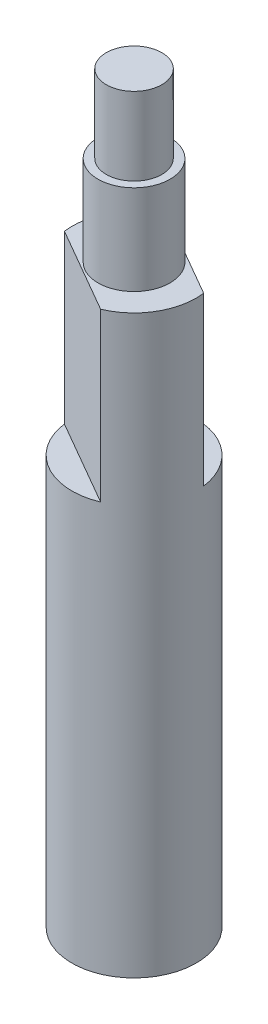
ISO-10303-21;
HEADER;
FILE_DESCRIPTION(('STEP AP214'),'2;1');
FILE_NAME('part.step','',(''),(''),'','','');
FILE_SCHEMA(('AUTOMOTIVE_DESIGN { 1 0 10303 214 1 1 1 1 }'));
ENDSEC;
DATA;
#1=APPLICATION_CONTEXT('core data for automotive mechanical design processes');
#2=APPLICATION_PROTOCOL_DEFINITION('international standard','automotive_design',2000,#1);
#3=PRODUCT_CONTEXT('',#1,'mechanical');
#4=PRODUCT('Part','Part','',(#3));
#5=PRODUCT_RELATED_PRODUCT_CATEGORY('part','',(#4));
#6=PRODUCT_DEFINITION_FORMATION('','',#4);
#7=PRODUCT_DEFINITION_CONTEXT('part definition',#1,'design');
#8=PRODUCT_DEFINITION('design','',#6,#7);
#9=PRODUCT_DEFINITION_SHAPE('','',#8);
#10=(LENGTH_UNIT() NAMED_UNIT(*) SI_UNIT(.MILLI.,.METRE.));
#11=(NAMED_UNIT(*) PLANE_ANGLE_UNIT() SI_UNIT($,.RADIAN.));
#12=(NAMED_UNIT(*) SI_UNIT($,.STERADIAN.) SOLID_ANGLE_UNIT());
#13=UNCERTAINTY_MEASURE_WITH_UNIT(LENGTH_MEASURE(1.E-05),#10,'distance_accuracy_value','');
#14=(GEOMETRIC_REPRESENTATION_CONTEXT(3) GLOBAL_UNCERTAINTY_ASSIGNED_CONTEXT((#13)) GLOBAL_UNIT_ASSIGNED_CONTEXT((#10,
#11,#12)) REPRESENTATION_CONTEXT('',''));
#15=CARTESIAN_POINT('',(0.,0.,0.));
#16=DIRECTION('',(0.,0.,1.));
#17=DIRECTION('',(1.,0.,0.));
#18=AXIS2_PLACEMENT_3D('',#15,#16,#17);
#19=CARTESIAN_POINT('',(625.914623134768,162.928044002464,0.));
#20=DIRECTION('',(0.,1.,0.));
#21=DIRECTION('',(0.,0.,1.));
#22=AXIS2_PLACEMENT_3D('',#19,#20,#21);
#23=PLANE('',#22);
#24=CARTESIAN_POINT('',(625.914623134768,162.928044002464,0.));
#25=DIRECTION('',(0.,-1.,0.));
#26=DIRECTION('',(0.,0.,-1.));
#27=AXIS2_PLACEMENT_3D('',#24,#25,#26);
#28=CIRCLE('',#27,2.4511);
#29=CARTESIAN_POINT('',(625.914623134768,162.928044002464,-2.4511));
#30=VERTEX_POINT('',#29);
#31=EDGE_CURVE('E19',#30,#30,#28,.T.);
#32=ORIENTED_EDGE('',*,*,#31,.F.);
#33=EDGE_LOOP('',(#32));
#34=FACE_BOUND('',#33,.T.);
#35=ADVANCED_FACE('F16',(#34),#23,.T.);
#36=CARTESIAN_POINT('',(625.914623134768,159.499044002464,0.));
#37=DIRECTION('',(0.,-1.,0.));
#38=DIRECTION('',(0.,0.,-1.));
#39=AXIS2_PLACEMENT_3D('',#36,#37,#38);
#40=CYLINDRICAL_SURFACE('',#39,2.4511);
#41=CARTESIAN_POINT('',(625.914623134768,156.070044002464,0.));
#42=DIRECTION('',(0.,-1.,0.));
#43=DIRECTION('',(0.,0.,-1.));
#44=AXIS2_PLACEMENT_3D('',#41,#42,#43);
#45=CIRCLE('',#44,2.4511);
#46=CARTESIAN_POINT('',(625.914623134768,156.070044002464,-2.4511));
#47=VERTEX_POINT('',#46);
#48=EDGE_CURVE('E62',#47,#47,#45,.T.);
#49=ORIENTED_EDGE('',*,*,#48,.F.);
#50=EDGE_LOOP('',(#49));
#51=FACE_BOUND('',#50,.T.);
#52=ORIENTED_EDGE('',*,*,#31,.T.);
#53=EDGE_LOOP('',(#52));
#54=FACE_BOUND('',#53,.T.);
#55=ADVANCED_FACE('F90',(#51,#54),#40,.T.);
#56=CARTESIAN_POINT('',(625.914623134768,156.070044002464,0.));
#57=DIRECTION('',(0.,1.,0.));
#58=DIRECTION('',(0.,0.,1.));
#59=AXIS2_PLACEMENT_3D('',#56,#57,#58);
#60=PLANE('',#59);
#61=ORIENTED_EDGE('',*,*,#48,.T.);
#62=EDGE_LOOP('',(#61));
#63=FACE_BOUND('',#62,.T.);
#64=CARTESIAN_POINT('',(625.914623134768,156.070044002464,0.));
#65=DIRECTION('',(0.,-1.,0.));
#66=DIRECTION('',(0.,0.,-1.));
#67=AXIS2_PLACEMENT_3D('',#64,#65,#66);
#68=CIRCLE('',#67,3.175);
#69=CARTESIAN_POINT('',(625.914623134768,156.070044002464,-3.175));
#70=VERTEX_POINT('',#69);
#71=EDGE_CURVE('E61',#70,#70,#68,.T.);
#72=ORIENTED_EDGE('',*,*,#71,.F.);
#73=EDGE_LOOP('',(#72));
#74=FACE_BOUND('',#73,.T.);
#75=ADVANCED_FACE('F97',(#63,#74),#60,.T.);
#76=CARTESIAN_POINT('',(622.345923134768,133.413244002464,6.18116971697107));
#77=DIRECTION('',(0.,1.,0.));
#78=DIRECTION('',(0.,0.,1.));
#79=AXIS2_PLACEMENT_3D('',#76,#77,#78);
#80=PLANE('',#79);
#81=CARTESIAN_POINT('',(625.914623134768,133.413244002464,0.));
#82=DIRECTION('',(0.,-1.,0.));
#83=DIRECTION('',(0.,0.,-1.));
#84=AXIS2_PLACEMENT_3D('',#81,#82,#83);
#85=CIRCLE('',#84,5.4864);
#86=CARTESIAN_POINT('',(628.028719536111,133.413244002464,5.06272469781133));
#87=VERTEX_POINT('',#86);
#88=CARTESIAN_POINT('',(620.473126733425,133.413244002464,0.700501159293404));
#89=VERTEX_POINT('',#88);
#90=EDGE_CURVE('E59',#87,#89,#85,.T.);
#91=ORIENTED_EDGE('',*,*,#90,.F.);
#92=DIRECTION('',(0.866025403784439,0.,0.5));
#93=VECTOR('',#92,1.);
#94=CARTESIAN_POINT('',(624.250923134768,133.413244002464,2.88161292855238));
#95=LINE('',#94,#93);
#96=EDGE_CURVE('E54',#89,#87,#95,.T.);
#97=ORIENTED_EDGE('',*,*,#96,.F.);
#98=EDGE_LOOP('',(#91,#97));
#99=FACE_BOUND('',#98,.T.);
#100=ADVANCED_FACE('F57',(#99),#80,.T.);
#101=CARTESIAN_POINT('',(624.250923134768,140.779244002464,2.88161292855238));
#102=DIRECTION('',(-0.5,0.,0.866025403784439));
#103=DIRECTION('',(0.866025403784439,0.,0.5));
#104=AXIS2_PLACEMENT_3D('',#101,#102,#103);
#105=PLANE('',#104);
#106=DIRECTION('',(0.,-1.,0.));
#107=VECTOR('',#106,1.);
#108=CARTESIAN_POINT('',(628.028719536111,122.745244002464,5.06272469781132));
#109=LINE('',#108,#107);
#110=CARTESIAN_POINT('',(628.028719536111,148.145244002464,5.06272469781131));
#111=VERTEX_POINT('',#110);
#112=EDGE_CURVE('E76',#111,#87,#109,.T.);
#113=ORIENTED_EDGE('',*,*,#112,.F.);
#114=DIRECTION('',(0.866025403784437,0.,0.500000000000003));
#115=VECTOR('',#114,1.);
#116=CARTESIAN_POINT('',(620.473126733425,148.145244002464,0.700501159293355));
#117=LINE('',#116,#115);
#118=CARTESIAN_POINT('',(620.473126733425,148.145244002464,0.700501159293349));
#119=VERTEX_POINT('',#118);
#120=EDGE_CURVE('E69',#119,#111,#117,.T.);
#121=ORIENTED_EDGE('',*,*,#120,.F.);
#122=DIRECTION('',(0.,-1.,0.));
#123=VECTOR('',#122,1.);
#124=CARTESIAN_POINT('',(620.473126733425,122.745244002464,0.700501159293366));
#125=LINE('',#124,#123);
#126=EDGE_CURVE('E66',#89,#119,#125,.F.);
#127=ORIENTED_EDGE('',*,*,#126,.F.);
#128=ORIENTED_EDGE('',*,*,#96,.T.);
#129=EDGE_LOOP('',(#113,#121,#127,#128));
#130=FACE_BOUND('',#129,.T.);
#131=ADVANCED_FACE('F67',(#130),#105,.T.);
#132=CARTESIAN_POINT('',(625.914623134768,152.107644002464,0.));
#133=DIRECTION('',(0.,-1.,0.));
#134=DIRECTION('',(0.,0.,-1.));
#135=AXIS2_PLACEMENT_3D('',#132,#133,#134);
#136=CYLINDRICAL_SURFACE('',#135,3.175);
#137=CARTESIAN_POINT('',(625.914623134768,148.145244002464,0.));
#138=DIRECTION('',(0.,-1.,0.));
#139=DIRECTION('',(0.,0.,-1.));
#140=AXIS2_PLACEMENT_3D('',#137,#138,#139);
#141=CIRCLE('',#140,3.175);
#142=CARTESIAN_POINT('',(625.914623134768,148.145244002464,-3.175));
#143=VERTEX_POINT('',#142);
#144=EDGE_CURVE('E81',#143,#143,#141,.T.);
#145=ORIENTED_EDGE('',*,*,#144,.F.);
#146=EDGE_LOOP('',(#145));
#147=FACE_BOUND('',#146,.T.);
#148=ORIENTED_EDGE('',*,*,#71,.T.);
#149=EDGE_LOOP('',(#148));
#150=FACE_BOUND('',#149,.T.);
#151=ADVANCED_FACE('F120',(#147,#150),#136,.T.);
#152=CARTESIAN_POINT('',(625.914623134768,97.3452440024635,0.));
#153=DIRECTION('',(0.,-1.,0.));
#154=DIRECTION('',(0.,0.,-1.));
#155=AXIS2_PLACEMENT_3D('',#152,#153,#154);
#156=PLANE('',#155);
#157=CARTESIAN_POINT('',(625.914623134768,97.3452440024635,0.));
#158=DIRECTION('',(0.,-1.,0.));
#159=DIRECTION('',(0.,0.,-1.));
#160=AXIS2_PLACEMENT_3D('',#157,#158,#159);
#161=CIRCLE('',#160,5.4864);
#162=CARTESIAN_POINT('',(625.914623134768,97.3452440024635,-5.4864));
#163=VERTEX_POINT('',#162);
#164=EDGE_CURVE('E204',#163,#163,#161,.F.);
#165=ORIENTED_EDGE('',*,*,#164,.F.);
#166=EDGE_LOOP('',(#165));
#167=FACE_BOUND('',#166,.T.);
#168=ADVANCED_FACE('F116',(#167),#156,.T.);
#169=CARTESIAN_POINT('',(629.483323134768,133.413244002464,-6.181169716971));
#170=DIRECTION('',(0.,1.,0.));
#171=DIRECTION('',(0.,0.,1.));
#172=AXIS2_PLACEMENT_3D('',#169,#170,#171);
#173=PLANE('',#172);
#174=CARTESIAN_POINT('',(625.914623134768,133.413244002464,0.));
#175=DIRECTION('',(0.,-1.,0.));
#176=DIRECTION('',(0.,0.,-1.));
#177=AXIS2_PLACEMENT_3D('',#174,#175,#176);
#178=CIRCLE('',#177,5.4864);
#179=CARTESIAN_POINT('',(623.800526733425,133.413244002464,-5.06272469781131));
#180=VERTEX_POINT('',#179);
#181=CARTESIAN_POINT('',(631.356119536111,133.413244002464,-0.700501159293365));
#182=VERTEX_POINT('',#181);
#183=EDGE_CURVE('E211',#180,#182,#178,.T.);
#184=ORIENTED_EDGE('',*,*,#183,.F.);
#185=DIRECTION('',(0.866025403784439,0.,0.5));
#186=VECTOR('',#185,1.);
#187=CARTESIAN_POINT('',(627.578323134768,133.413244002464,-2.8816129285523));
#188=LINE('',#187,#186);
#189=EDGE_CURVE('E72',#180,#182,#188,.T.);
#190=ORIENTED_EDGE('',*,*,#189,.T.);
#191=EDGE_LOOP('',(#184,#190));
#192=FACE_BOUND('',#191,.T.);
#193=ADVANCED_FACE('F113',(#192),#173,.T.);
#194=CARTESIAN_POINT('',(627.578323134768,140.779244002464,-2.8816129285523));
#195=DIRECTION('',(-0.5,0.,0.866025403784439));
#196=DIRECTION('',(0.866025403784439,0.,0.5));
#197=AXIS2_PLACEMENT_3D('',#194,#195,#196);
#198=PLANE('',#197);
#199=ORIENTED_EDGE('',*,*,#189,.F.);
#200=DIRECTION('',(0.,-1.,0.));
#201=VECTOR('',#200,1.);
#202=CARTESIAN_POINT('',(623.800526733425,122.745244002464,-5.06272469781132));
#203=LINE('',#202,#201);
#204=CARTESIAN_POINT('',(623.800526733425,148.145244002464,-5.06272469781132));
#205=VERTEX_POINT('',#204);
#206=EDGE_CURVE('E213',#205,#180,#203,.T.);
#207=ORIENTED_EDGE('',*,*,#206,.F.);
#208=DIRECTION('',(-0.866025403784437,0.,-0.500000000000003));
#209=VECTOR('',#208,1.);
#210=CARTESIAN_POINT('',(631.356119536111,148.145244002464,-0.700501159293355));
#211=LINE('',#210,#209);
#212=CARTESIAN_POINT('',(631.356119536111,148.145244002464,-0.700501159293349));
#213=VERTEX_POINT('',#212);
#214=EDGE_CURVE('E34',#213,#205,#211,.T.);
#215=ORIENTED_EDGE('',*,*,#214,.F.);
#216=DIRECTION('',(0.,-1.,0.));
#217=VECTOR('',#216,1.);
#218=CARTESIAN_POINT('',(631.356119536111,122.745244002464,-0.700501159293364));
#219=LINE('',#218,#217);
#220=EDGE_CURVE('E25',#182,#213,#219,.F.);
#221=ORIENTED_EDGE('',*,*,#220,.F.);
#222=EDGE_LOOP('',(#199,#207,#215,#221));
#223=FACE_BOUND('',#222,.T.);
#224=ADVANCED_FACE('F106',(#223),#198,.F.);
#225=CARTESIAN_POINT('',(625.914623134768,148.145244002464,0.));
#226=DIRECTION('',(0.,1.,0.));
#227=DIRECTION('',(0.,0.,1.));
#228=AXIS2_PLACEMENT_3D('',#225,#226,#227);
#229=PLANE('',#228);
#230=ORIENTED_EDGE('',*,*,#144,.T.);
#231=EDGE_LOOP('',(#230));
#232=FACE_BOUND('',#231,.T.);
#233=CARTESIAN_POINT('',(625.914623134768,148.145244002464,0.));
#234=DIRECTION('',(0.,-1.,0.));
#235=DIRECTION('',(0.,0.,-1.));
#236=AXIS2_PLACEMENT_3D('',#233,#234,#235);
#237=CIRCLE('',#236,5.4864);
#238=EDGE_CURVE('E205',#119,#205,#237,.T.);
#239=ORIENTED_EDGE('',*,*,#238,.F.);
#240=ORIENTED_EDGE('',*,*,#120,.T.);
#241=CARTESIAN_POINT('',(625.914623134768,148.145244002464,0.));
#242=DIRECTION('',(0.,-1.,0.));
#243=DIRECTION('',(0.,0.,-1.));
#244=AXIS2_PLACEMENT_3D('',#241,#242,#243);
#245=CIRCLE('',#244,5.4864);
#246=EDGE_CURVE('E11',#213,#111,#245,.T.);
#247=ORIENTED_EDGE('',*,*,#246,.F.);
#248=ORIENTED_EDGE('',*,*,#214,.T.);
#249=EDGE_LOOP('',(#239,#240,#247,#248));
#250=FACE_BOUND('',#249,.T.);
#251=ADVANCED_FACE('F100',(#232,#250),#229,.T.);
#252=CARTESIAN_POINT('',(625.914623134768,122.745244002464,0.));
#253=DIRECTION('',(0.,-1.,0.));
#254=DIRECTION('',(0.,0.,-1.));
#255=AXIS2_PLACEMENT_3D('',#252,#253,#254);
#256=CYLINDRICAL_SURFACE('',#255,5.4864);
#257=ORIENTED_EDGE('',*,*,#164,.T.);
#258=EDGE_LOOP('',(#257));
#259=FACE_BOUND('',#258,.T.);
#260=ORIENTED_EDGE('',*,*,#220,.T.);
#261=ORIENTED_EDGE('',*,*,#246,.T.);
#262=ORIENTED_EDGE('',*,*,#112,.T.);
#263=ORIENTED_EDGE('',*,*,#90,.T.);
#264=ORIENTED_EDGE('',*,*,#126,.T.);
#265=ORIENTED_EDGE('',*,*,#238,.T.);
#266=ORIENTED_EDGE('',*,*,#206,.T.);
#267=ORIENTED_EDGE('',*,*,#183,.T.);
#268=EDGE_LOOP('',(#260,#261,#262,#263,#264,#265,#266,#267));
#269=FACE_BOUND('',#268,.T.);
#270=ADVANCED_FACE('F75',(#259,#269),#256,.T.);
#271=CLOSED_SHELL('',(#35,#55,#75,#100,#131,#151,#168,#193,#224,#251,#270));
#272=MANIFOLD_SOLID_BREP('B1',#271);
#273=ADVANCED_BREP_SHAPE_REPRESENTATION('',(#18,#272),#14);
#274=SHAPE_DEFINITION_REPRESENTATION(#9,#273);
ENDSEC;
END-ISO-10303-21;
